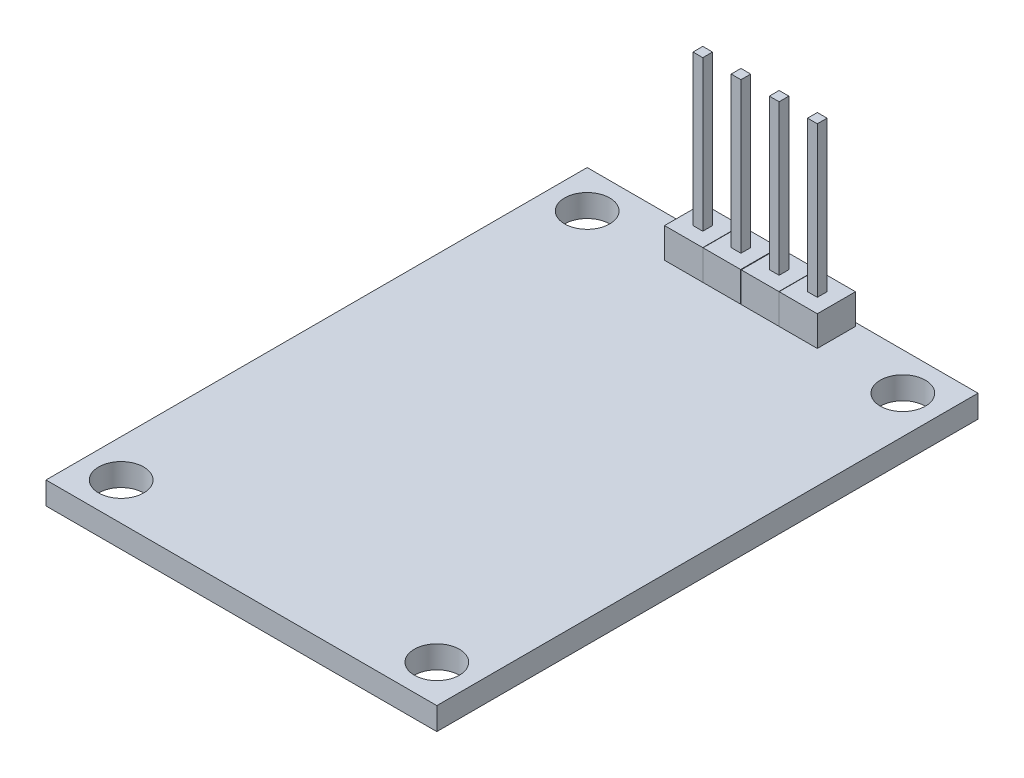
from build123d import *

# Parameters (mm, degrees)
SKETCH1_W                = 26
SKETCH1_H                = 36
BOSS_EXTRUDE1_DEPTH      = 1.5
SKETCH2_R                = 1.5
CUT_EXTRUDE1_DEPTH       = 1.5
SKETCH3_W                = 2.5
SKETCH3_H                = 2.54
SKETCH3_W_2              = 2.54
BOSS_EXTRUDE2_DEPTH      = 2
BOSS_EXTRUDE3_DEPTH      = 10
BOSS_EXTRUDE3_DEPTH_BACK = 5
SKETCH4_W                = 0.65
SKETCH4_H                = 0.65
SKETCH5_W                = 15
SKETCH5_H                = 11.5
BOSS_EXTRUDE4_DEPTH      = 2.5
SKETCH6_W                = 1.833556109
SKETCH6_H                = 1.290280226
SKETCH6_W_2              = 1.969375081
SKETCH6_W_3              = 1.697737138
SKETCH6_W_4              = 1.561918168
BOSS_EXTRUDE5_DEPTH      = 1.5
FILLET1_R                = 0.5
CUT_EXTRUDE2_DEPTH       = 0.5


with BuildPart() as part:
    # Sketch1 → Boss-Extrude1 (new body)
    with BuildSketch(Plane(origin=(0, 0, 0), x_dir=(1, 0, 0), z_dir=(0, 1, 0))):
        Rectangle(SKETCH1_W, SKETCH1_H)
    extrude(amount=BOSS_EXTRUDE1_DEPTH)

    # Sketch2 → Cut-Extrude1 (cut)
    with BuildSketch(Plane(origin=(0, 1.5, 0), x_dir=(1, 0, 0), z_dir=(0, 1, 0))):
        with Locations(Location((-10.5, 15.5, 0), (0, 0, 270))):
            Circle(SKETCH2_R)
        with Locations(Location((10.5, 15.5, 0), (0, 0, 270))):
            Circle(SKETCH2_R)
        with Locations(Location((10.5, -15.5, 0), (0, 0, 270))):
            Circle(SKETCH2_R)
        with Locations(Location((-10.5, -15.5, 0), (0, 0, 270))):
            Circle(SKETCH2_R)
    extrude(amount=-CUT_EXTRUDE1_DEPTH, mode=Mode.SUBTRACT)

    # Sketch3 → Boss-Extrude2 (add)
    with BuildSketch(Plane(origin=(0, 1.5, 0), x_dir=(1, 0, 0), z_dir=(0, 1, 0))):
        with Locations((1.27, 16.5)):
            Rectangle(SKETCH3_W, SKETCH3_H)
        with Locations((-3.81, 16.5)):
            Rectangle(SKETCH3_W_2, SKETCH3_H)
        with Locations((3.81, 16.5)):
            Rectangle(SKETCH3_W_2, SKETCH3_H)
        with Locations((-1.27, 16.5)):
            Rectangle(SKETCH3_W, SKETCH3_H)
    extrude(amount=BOSS_EXTRUDE2_DEPTH)

    # Sketch4 → Boss-Extrude3 (add, two sides: drawn at the far end of the back side and taken through both)
    with BuildSketch(Plane(origin=(0, 3.5, 0), x_dir=(1, 0, 0), z_dir=(0, 1, 0)).offset(-BOSS_EXTRUDE3_DEPTH_BACK)):
        with Locations((-3.81, 16.5)):
            Rectangle(SKETCH4_W, SKETCH4_H)
        with Locations((-1.27, 16.5)):
            Rectangle(SKETCH4_W, SKETCH4_H)
        with Locations((1.27, 16.5)):
            Rectangle(SKETCH4_W, SKETCH4_H)
        with Locations((3.81, 16.5)):
            Rectangle(SKETCH4_W, SKETCH4_H)
    extrude(amount=BOSS_EXTRUDE3_DEPTH + BOSS_EXTRUDE3_DEPTH_BACK)

    # Sketch5 → Boss-Extrude4 (add)
    with BuildSketch(Plane.XZ):
        with Locations((0, 0.75)):
            Rectangle(SKETCH5_W, SKETCH5_H)
    extrude(amount=BOSS_EXTRUDE4_DEPTH)

    # Sketch6 → Boss-Extrude5 (add)
    with BuildSketch(Plane.XZ):
        with Locations((1.078775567, -11.02953631)):
            Rectangle(SKETCH6_W, SKETCH6_H)
        with Locations((3.455607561, -11.02953631)):
            Rectangle(SKETCH6_W_2, SKETCH6_H)
        with Locations((5.832439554, -11.02953631)):
            Rectangle(SKETCH6_W_3, SKETCH6_H)
        with Locations((8.039497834, -11.02953631)):
            Rectangle(SKETCH6_W_4, SKETCH6_H)
    extrude(amount=BOSS_EXTRUDE5_DEPTH)

    # Fillet1
    fillet1_edges = [part.edges().sort_by_distance(p)[0] for p in [
        (7.5, -2.5, 0.75),
        (0, -2.5, 6.5),
        (-7.5, -2.5, 0.75),
        (0, -2.5, -5),
    ]]
    fillet(fillet1_edges, radius=FILLET1_R)

    # Sketch7 → Cut-Extrude2 (cut)
    # profile 1 of 3: a face of its own
    with BuildSketch(Plane.XZ.offset(2.5)):
        with BuildLine():
            Line((-0.95224416, 1.042060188), (-1.221474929, 0.786851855))
            add(Edge.make_bspline(
                [(-1.221474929, 0.786851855), (-1.270193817, 0.832682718), (-1.366469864, 0.923251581), (-1.523430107, 1.040762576), (-1.687193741, 1.141428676), (-1.856906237, 1.223334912), (-2.028364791, 1.288687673), (-2.199293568, 1.335215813), (-2.367939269, 1.364888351), (-2.480106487, 1.36843672), (-2.535377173, 1.370185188)],
                knots=[0, 0, 0, 0, 1.08915593, 2.152340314, 3.188132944, 4.216796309, 5.218260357, 6.173443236, 7.099959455, 8, 8, 8, 8], degree=3))
            add(Edge.make_bspline(
                [(-2.535377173, 1.370185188), (-2.569291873, 1.369771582), (-2.637033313, 1.368945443), (-2.737655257, 1.358401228), (-2.837221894, 1.343236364), (-2.935545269, 1.321294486), (-3.032816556, 1.293485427), (-3.128697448, 1.258699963), (-3.223366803, 1.218144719), (-3.315932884, 1.171282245), (-3.405673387, 1.119802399), (-3.490430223, 1.062753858), (-3.570743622, 1.001965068), (-3.645104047, 0.935914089), (-3.713939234, 0.865199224), (-3.778887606, 0.791135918), (-3.837664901, 0.711700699), (-3.890756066, 0.628355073), (-3.938117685, 0.542562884), (-3.979926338, 0.455149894), (-4.015023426, 0.36640604), (-4.042792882, 0.276219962), (-4.065703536, 0.185289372), (-4.081821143, 0.092984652), (-4.090907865, -0.000793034), (-4.092479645, -0.063590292), (-4.093269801, -0.095159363)],
                knots=[0, 0, 0, 0, 1.02818874, 2.053710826, 3.065248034, 4.081641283, 5.106893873, 6.131558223, 7.173050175, 8.228653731, 9.27666206, 10.308777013, 11.325269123, 12.329503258, 13.32196095, 14.316845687, 15.314881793, 16.315733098, 17.311955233, 18.285320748, 19.252783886, 20.203351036, 21.145449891, 22.095197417, 23.042428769, 24, 24, 24, 24], degree=3))
            add(Edge.make_bspline(
                [(-4.093269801, -0.095159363), (-4.092514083, -0.12743018), (-4.09100471, -0.191883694), (-4.08134439, -0.288077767), (-4.06341615, -0.382843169), (-4.039448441, -0.476491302), (-4.009467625, -0.56918255), (-3.972094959, -0.66051506), (-3.927829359, -0.750485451), (-3.876592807, -0.838283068), (-3.820406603, -0.923806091), (-3.757463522, -1.004365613), (-3.690602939, -1.08103439), (-3.617389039, -1.152110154), (-3.540169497, -1.21949405), (-3.456637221, -1.281329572), (-3.36843476, -1.338807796), (-3.275427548, -1.391204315), (-3.178624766, -1.438012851), (-3.079368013, -1.479636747), (-2.977340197, -1.513916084), (-2.873077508, -1.541854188), (-2.766704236, -1.564754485), (-2.657680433, -1.579486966), (-2.546807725, -1.590177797), (-2.472069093, -1.590959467), (-2.434415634, -1.591353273)],
                knots=[0, 0, 0, 0, 0.93586088, 1.869166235, 2.799637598, 3.729985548, 4.670839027, 5.622275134, 6.589130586, 7.576015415, 8.568469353, 9.55398029, 10.53834874, 11.515998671, 12.510579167, 13.508179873, 14.527009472, 15.561807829, 16.601455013, 17.643573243, 18.680854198, 19.719860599, 20.772568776, 21.833555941, 22.908541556, 24, 24, 24, 24], degree=3))
            add(Edge.make_bspline(
                [(-2.434415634, -1.591353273), (-2.389037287, -1.590404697), (-2.29992953, -1.588542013), (-2.168943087, -1.574041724), (-2.043140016, -1.55139493), (-1.922873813, -1.518229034), (-1.808004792, -1.475925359), (-1.698111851, -1.424929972), (-1.594060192, -1.363286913), (-1.495537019, -1.293713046), (-1.404779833, -1.216198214), (-1.322925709, -1.132553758), (-1.25128022, -1.043185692), (-1.188775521, -0.948620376), (-1.137066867, -0.848075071), (-1.094624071, -0.742042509), (-1.06209078, -0.630474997), (-1.048735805, -0.553383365), (-1.04198775, -0.514430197)],
                knots=[0, 0, 0, 0, 1.13008108, 2.219097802, 3.278683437, 4.311054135, 5.322181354, 6.324827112, 7.324222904, 8.330512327, 9.32562643, 10.293043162, 11.24128371, 12.174520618, 13.111833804, 14.052305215, 15.015860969, 16, 16, 16, 16], degree=3))
            Line((-1.04198775, -0.514430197), (-2.208654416, -0.514430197))
            Line((-2.208654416, -0.514430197), (-2.208654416, -0.155455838))
            Line((-2.208654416, -0.155455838), (-0.727885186, -0.155455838))
            add(Edge.make_bspline(
                [(-0.727885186, -0.155455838), (-0.729591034, -0.222363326), (-0.732929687, -0.353313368), (-0.756348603, -0.544283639), (-0.794165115, -0.724655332), (-0.845825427, -0.894618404), (-0.912700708, -1.053931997), (-0.994073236, -1.202757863), (-1.091245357, -1.340134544), (-1.200755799, -1.467183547), (-1.323655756, -1.58051276), (-1.456624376, -1.680118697), (-1.599881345, -1.764021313), (-1.753291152, -1.832281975), (-1.916351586, -1.88555597), (-2.089439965, -1.923327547), (-2.272321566, -1.94595751), (-2.397658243, -1.94884889), (-2.461759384, -1.950327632)],
                knots=[0, 0, 0, 0, 1.140356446, 2.231883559, 3.274166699, 4.278491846, 5.25512956, 6.21435461, 7.1637429, 8.11826594, 9.068280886, 10.0076534, 10.945064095, 11.891975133, 12.864533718, 13.863980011, 14.907571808, 16, 16, 16, 16], degree=3))
            add(Edge.make_bspline(
                [(-2.461759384, -1.950327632), (-2.50126952, -1.949758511), (-2.579196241, -1.948636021), (-2.694287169, -1.940658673), (-2.806204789, -1.928378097), (-2.914932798, -1.909832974), (-3.02087114, -1.887118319), (-3.123490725, -1.858031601), (-3.223182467, -1.824362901), (-3.320100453, -1.786067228), (-3.413365, -1.741695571), (-3.503391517, -1.692385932), (-3.590677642, -1.638392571), (-3.674628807, -1.578781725), (-3.755682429, -1.513999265), (-3.833315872, -1.443915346), (-3.907963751, -1.368744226), (-3.954724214, -1.315365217), (-3.978285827, -1.288468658)],
                knots=[0, 0, 0, 0, 1.107784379, 2.184907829, 3.233506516, 4.263428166, 5.276301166, 6.270063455, 7.25232949, 8.225834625, 9.190232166, 10.146266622, 11.1027726, 12.066435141, 13.031522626, 14.010570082, 14.99756817, 16, 16, 16, 16], degree=3))
            add(Edge.make_bspline(
                [(-3.978285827, -1.288468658), (-4.012471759, -1.245798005), (-4.080276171, -1.161164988), (-4.167554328, -1.025565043), (-4.241955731, -0.885163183), (-4.302323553, -0.739568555), (-4.349461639, -0.588917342), (-4.383267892, -0.433402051), (-4.403075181, -0.27282242), (-4.405928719, -0.164157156), (-4.407372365, -0.109181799)],
                knots=[0, 0, 0, 0, 1.023165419, 2.029347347, 3.013907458, 3.994755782, 4.975994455, 5.96558838, 6.970761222, 8, 8, 8, 8], degree=3))
            add(Edge.make_bspline(
                [(-4.407372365, -0.109181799), (-4.406840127, -0.068015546), (-4.405782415, 0.013793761), (-4.392956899, 0.135251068), (-4.374555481, 0.254551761), (-4.347508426, 0.371598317), (-4.313412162, 0.486468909), (-4.270858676, 0.599216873), (-4.22131378, 0.709908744), (-4.163728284, 0.817782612), (-4.099643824, 0.921407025), (-4.030093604, 1.020364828), (-3.954090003, 1.112853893), (-3.872874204, 1.200045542), (-3.785477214, 1.280844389), (-3.69271779, 1.355998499), (-3.594524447, 1.425608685), (-3.490588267, 1.48857852), (-3.382460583, 1.54514214), (-3.270400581, 1.594731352), (-3.15444247, 1.635714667), (-3.035454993, 1.670488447), (-2.912537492, 1.696203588), (-2.786581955, 1.714852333), (-2.656931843, 1.727612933), (-2.569295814, 1.728639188), (-2.524860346, 1.729159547)],
                knots=[0, 0, 0, 0, 1.008945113, 2.00506715, 2.99143336, 3.967273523, 4.948097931, 5.927297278, 6.919902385, 7.919676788, 8.923139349, 9.905703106, 10.883022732, 11.856032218, 12.825136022, 13.798837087, 14.781400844, 15.773989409, 16.776158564, 17.77167057, 18.775803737, 19.789618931, 20.80898985, 21.851988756, 22.910860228, 24, 24, 24, 24], degree=3))
            add(Edge.make_bspline(
                [(-2.524860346, 1.729159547), (-2.488622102, 1.728580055), (-2.416765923, 1.727430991), (-2.309840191, 1.719466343), (-2.204567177, 1.706842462), (-2.100790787, 1.689615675), (-1.99886442, 1.666151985), (-1.898497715, 1.6380737), (-1.799545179, 1.605381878), (-1.70231693, 1.566393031), (-1.606159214, 1.522139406), (-1.510537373, 1.472325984), (-1.415778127, 1.416100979), (-1.321717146, 1.353297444), (-1.227761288, 1.284994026), (-1.135396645, 1.209237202), (-1.042393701, 1.129014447), (-0.982591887, 1.071332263), (-0.95224416, 1.042060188)],
                knots=[0, 0, 0, 0, 0.985871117, 1.954866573, 2.915460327, 3.869826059, 4.81536089, 5.759505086, 6.70452669, 7.649098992, 8.607881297, 9.583363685, 10.581137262, 11.603961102, 12.659522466, 13.73993555, 14.853081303, 16, 16, 16, 16], degree=3))
        make_face()
    # profile 2 of 3: a face of its own
    with BuildSketch(Plane.XZ.offset(2.5)):
        with BuildLine():
            Line((-0.009936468, 1.639415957), (0.676461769, 1.639415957))
            add(Edge.make_bspline(
                [(0.676461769, 1.639415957), (0.723672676, 1.639364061), (0.814130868, 1.639264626), (0.943845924, 1.63624988), (1.061655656, 1.632223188), (1.167306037, 1.626641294), (1.261122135, 1.620044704), (1.342679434, 1.610792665), (1.412618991, 1.601132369), (1.45452544, 1.591310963), (1.47363725, 1.586831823)],
                knots=[0, 0, 0, 0, 1.415646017, 2.712440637, 3.8905458, 4.950247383, 5.884950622, 6.709939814, 7.411656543, 8, 8, 8, 8], degree=3))
            add(Edge.make_bspline(
                [(1.47363725, 1.586831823), (1.497830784, 1.580209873), (1.545647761, 1.567122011), (1.614548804, 1.540908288), (1.68010265, 1.509826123), (1.742534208, 1.474402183), (1.801076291, 1.433116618), (1.856602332, 1.387643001), (1.908622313, 1.336931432), (1.956843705, 1.281550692), (2.001128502, 1.222430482), (2.039258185, 1.158688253), (2.071185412, 1.091396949), (2.098568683, 1.020603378), (2.118277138, 0.945713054), (2.133124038, 0.867246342), (2.142547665, 0.785211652), (2.143450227, 0.729151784), (2.143909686, 0.700613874)],
                knots=[0, 0, 0, 0, 0.999701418, 1.975846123, 2.934577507, 3.890451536, 4.834027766, 5.787354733, 6.749476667, 7.726910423, 8.712836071, 9.690891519, 10.682875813, 11.679750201, 12.712814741, 13.765529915, 14.8625177, 16, 16, 16, 16], degree=3))
            add(Edge.make_bspline(
                [(2.143909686, 0.700613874), (2.143488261, 0.671836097), (2.142663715, 0.615530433), (2.13276743, 0.533157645), (2.119437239, 0.454439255), (2.098940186, 0.379549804), (2.072094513, 0.308934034), (2.04060246, 0.241512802), (2.00261893, 0.17843313), (1.9589741, 0.119466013), (1.910422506, 0.0645561), (1.857169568, 0.014101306), (1.799430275, -0.031603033), (1.737388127, -0.072659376), (1.670438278, -0.108115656), (1.599596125, -0.139872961), (1.524245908, -0.166544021), (1.472103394, -0.180574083), (1.445592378, -0.18770744)],
                knots=[0, 0, 0, 0, 1.121902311, 2.195077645, 3.232258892, 4.234102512, 5.217864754, 6.176164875, 7.132989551, 8.084763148, 9.034132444, 9.988522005, 10.94243251, 11.903244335, 12.886203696, 13.894208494, 14.929344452, 16, 16, 16, 16], degree=3))
            add(Edge.make_bspline(
                [(1.445592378, -0.18770744), (1.423665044, -0.192370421), (1.375610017, -0.202589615), (1.296467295, -0.213998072), (1.204321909, -0.223735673), (1.099299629, -0.23103681), (0.981494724, -0.237287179), (0.850843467, -0.242255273), (0.70708939, -0.244985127), (0.606818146, -0.245125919), (0.554466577, -0.245199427)],
                knots=[0, 0, 0, 0, 0.601384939, 1.31797006, 2.144135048, 3.087295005, 4.142315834, 5.309527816, 6.595305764, 8, 8, 8, 8], degree=3))
            Line((0.554466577, -0.245199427), (0.304166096, -0.245199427))
            Line((0.304166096, -0.245199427), (0.304166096, -1.860584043))
            Line((0.304166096, -1.860584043), (-0.009936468, -1.860584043))
            Line((-0.009936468, -1.860584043), (-0.009936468, 1.639415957))
        make_face()
        with BuildLine():
            Line((0.304166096, 1.280441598), (0.304166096, 0.113774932))
            Line((0.304166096, 0.113774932), (0.916946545, 0.106062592))
            add(Edge.make_bspline(
                [(0.916946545, 0.106062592), (0.946866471, 0.106047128), (1.004626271, 0.106017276), (1.088062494, 0.1100025), (1.165471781, 0.114603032), (1.236616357, 0.121338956), (1.301528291, 0.130860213), (1.36031582, 0.140471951), (1.412523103, 0.154377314), (1.473622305, 0.173100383), (1.541705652, 0.205032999), (1.615773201, 0.251382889), (1.678543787, 0.310463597), (1.732862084, 0.376891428), (1.775967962, 0.450790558), (1.807523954, 0.529859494), (1.826065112, 0.613287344), (1.828551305, 0.670375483), (1.829807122, 0.69921163)],
                knots=[0, 0, 0, 0, 1.160613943, 2.240541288, 3.23993089, 4.169200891, 5.011653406, 5.7853311, 6.478053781, 7.106038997, 8.262395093, 9.384106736, 10.481365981, 11.59014053, 12.70357646, 13.786202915, 14.881775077, 16, 16, 16, 16], degree=3))
            add(Edge.make_bspline(
                [(1.829807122, 0.69921163), (1.828544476, 0.727350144), (1.826034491, 0.783286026), (1.807378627, 0.865264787), (1.776029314, 0.943500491), (1.732572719, 1.016473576), (1.679831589, 1.08266238), (1.618532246, 1.140159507), (1.548818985, 1.18638121), (1.483970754, 1.216214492), (1.426369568, 1.234429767), (1.376337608, 1.247174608), (1.319846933, 1.257350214), (1.256879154, 1.265589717), (1.18792232, 1.272643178), (1.112384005, 1.277429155), (1.030550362, 1.280230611), (0.973739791, 1.280369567), (0.944290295, 1.280441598)],
                knots=[0, 0, 0, 0, 1.120700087, 2.227813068, 3.331159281, 4.466773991, 5.599788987, 6.693661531, 7.80175334, 8.91857717, 9.525282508, 10.207424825, 10.974604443, 11.810962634, 12.737642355, 13.736264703, 14.826523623, 16, 16, 16, 16], degree=3))
            Line((0.944290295, 1.280441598), (0.304166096, 1.280441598))
        make_face(mode=Mode.SUBTRACT)
    # profile 3 of 3: a face of its own
    with BuildSketch(Plane.XZ.offset(2.5)):
        with BuildLine():
            Line((2.502884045, -1.185403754), (2.798757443, -1.00801994))
            add(Edge.make_bspline(
                [(2.798757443, -1.00801994), (2.82627568, -1.054084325), (2.87899956, -1.142341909), (2.96695092, -1.261599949), (3.058083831, -1.362962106), (3.153073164, -1.445838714), (3.251339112, -1.5110876), (3.353523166, -1.557289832), (3.459280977, -1.586105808), (3.531254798, -1.589605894), (3.56718693, -1.591353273)],
                knots=[0, 0, 0, 0, 1.272034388, 2.437168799, 3.508375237, 4.49857839, 5.41946034, 6.295179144, 7.148887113, 8, 8, 8, 8], degree=3))
            add(Edge.make_bspline(
                [(3.56718693, -1.591353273), (3.59787379, -1.590498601), (3.658710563, -1.588804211), (3.748272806, -1.572523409), (3.835254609, -1.54751128), (3.917863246, -1.511690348), (3.994958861, -1.468351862), (4.062565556, -1.416005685), (4.121011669, -1.357399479), (4.168820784, -1.292016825), (4.205500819, -1.221699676), (4.233692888, -1.149523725), (4.249337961, -1.074355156), (4.251694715, -1.023744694), (4.252884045, -0.998204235)],
                knots=[0, 0, 0, 0, 1.095163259, 2.171163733, 3.241058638, 4.321873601, 5.38011039, 6.391990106, 7.366004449, 8.327778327, 9.272591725, 10.192022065, 11.087607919, 12, 12, 12, 12], degree=3))
            add(Edge.make_bspline(
                [(4.252884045, -0.998204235), (4.251409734, -0.969063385), (4.248412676, -0.909824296), (4.223081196, -0.822424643), (4.183231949, -0.735932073), (4.146469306, -0.682430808), (4.127383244, -0.654654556)],
                knots=[0, 0, 0, 0, 0.938893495, 1.908633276, 2.914225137, 4, 4, 4, 4], degree=3))
            add(Edge.make_bspline(
                [(4.127383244, -0.654654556), (4.11171263, -0.634607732), (4.078814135, -0.592521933), (4.022256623, -0.529876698), (3.955890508, -0.465258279), (3.881986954, -0.396199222), (3.797853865, -0.325911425), (3.70612635, -0.251043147), (3.604462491, -0.17444157), (3.533162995, -0.123069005), (3.496373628, -0.096561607)],
                knots=[0, 0, 0, 0, 0.722233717, 1.516239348, 2.393582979, 3.351407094, 4.387010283, 5.505090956, 6.712668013, 8, 8, 8, 8], degree=3))
            add(Edge.make_bspline(
                [(3.496373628, -0.096561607), (3.459549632, -0.070333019), (3.389144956, -0.020185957), (3.290686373, 0.054238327), (3.20264191, 0.122282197), (3.125402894, 0.184586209), (3.059003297, 0.241158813), (3.002919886, 0.291456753), (2.958581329, 0.336840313), (2.933925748, 0.366281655), (2.922856, 0.379500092)],
                knots=[0, 0, 0, 0, 1.452282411, 2.77665338, 3.964542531, 5.026858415, 5.96415736, 6.766646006, 7.446254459, 8, 8, 8, 8], degree=3))
            add(Edge.make_bspline(
                [(2.922856, 0.379500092), (2.907383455, 0.400101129), (2.876954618, 0.440615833), (2.836788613, 0.50394069), (2.80264945, 0.568763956), (2.775887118, 0.63525982), (2.753350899, 0.702494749), (2.738192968, 0.771345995), (2.728701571, 0.841504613), (2.727729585, 0.888718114), (2.727243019, 0.912352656)],
                knots=[0, 0, 0, 0, 1.068054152, 2.10047183, 3.106115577, 4.101338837, 5.06977816, 6.043150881, 7.020423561, 8, 8, 8, 8], degree=3))
            add(Edge.make_bspline(
                [(2.727243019, 0.912352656), (2.728548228, 0.949382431), (2.731130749, 1.022650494), (2.752971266, 1.129681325), (2.787444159, 1.231867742), (2.835739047, 1.328198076), (2.8979964, 1.416164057), (2.970042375, 1.496777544), (3.055853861, 1.564546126), (3.150006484, 1.623758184), (3.253062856, 1.670104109), (3.36105376, 1.70506509), (3.474150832, 1.724874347), (3.550753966, 1.727717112), (3.589622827, 1.729159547)],
                knots=[0, 0, 0, 0, 1.005424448, 1.989358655, 2.955360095, 3.929531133, 4.905563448, 5.876582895, 6.856512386, 7.866279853, 8.892233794, 9.918561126, 10.94386622, 12, 12, 12, 12], degree=3))
            add(Edge.make_bspline(
                [(3.589622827, 1.729159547), (3.630866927, 1.727736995), (3.712888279, 1.724907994), (3.833537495, 1.700310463), (3.949698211, 1.659609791), (4.043141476, 1.613421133), (4.116274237, 1.567289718), (4.17204697, 1.525269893), (4.228564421, 1.476894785), (4.286282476, 1.422035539), (4.344223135, 1.360188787), (4.403246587, 1.291778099), (4.463490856, 1.217221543), (4.502246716, 1.163997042), (4.522114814, 1.13671163)],
                knots=[0, 0, 0, 0, 1.286793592, 2.559021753, 3.825965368, 5.121522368, 5.803751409, 6.523245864, 7.299691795, 8.125521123, 9.008227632, 9.944561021, 10.946284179, 12, 12, 12, 12], degree=3))
            Line((4.522114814, 1.13671163), (4.238160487, 0.921467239))
            add(Edge.make_bspline(
                [(4.238160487, 0.921467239), (4.221014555, 0.94355593), (4.187995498, 0.986093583), (4.137866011, 1.045664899), (4.090617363, 1.100081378), (4.044066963, 1.147346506), (4.000673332, 1.19004864), (3.95855629, 1.226608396), (3.918321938, 1.257383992), (3.867605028, 1.290227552), (3.803887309, 1.322784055), (3.723902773, 1.350333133), (3.640316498, 1.366888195), (3.583386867, 1.369077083), (3.554566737, 1.370185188)],
                knots=[0, 0, 0, 0, 1.181633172, 2.275549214, 3.290209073, 4.226197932, 5.078386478, 5.862611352, 6.581680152, 7.217281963, 8.414376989, 9.595101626, 10.782541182, 12, 12, 12, 12], degree=3))
            add(Edge.make_bspline(
                [(3.554566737, 1.370185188), (3.518410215, 1.368973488), (3.448685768, 1.366636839), (3.349695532, 1.341116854), (3.260601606, 1.300934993), (3.184049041, 1.244620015), (3.120312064, 1.177899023), (3.074206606, 1.101120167), (3.046456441, 1.016337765), (3.043070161, 0.957196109), (3.041345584, 0.927076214)],
                knots=[0, 0, 0, 0, 1.14458467, 2.207223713, 3.21896685, 4.227309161, 5.202851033, 6.127160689, 7.046193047, 8, 8, 8, 8], degree=3))
            add(Edge.make_bspline(
                [(3.041345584, 0.927076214), (3.04173871, 0.908324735), (3.042525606, 0.870791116), (3.053500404, 0.815339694), (3.067599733, 0.760028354), (3.089942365, 0.705105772), (3.120787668, 0.649611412), (3.161292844, 0.592589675), (3.212306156, 0.533537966), (3.251383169, 0.495130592), (3.272014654, 0.474852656)],
                knots=[0, 0, 0, 0, 0.858281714, 1.717966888, 2.583508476, 3.4729293, 4.427298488, 5.488583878, 6.674047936, 8, 8, 8, 8], degree=3))
            add(Edge.make_bspline(
                [(3.272014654, 0.474852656), (3.279676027, 0.46801563), (3.297877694, 0.451772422), (3.331153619, 0.425180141), (3.375096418, 0.392377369), (3.428558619, 0.351790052), (3.492525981, 0.30470859), (3.567005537, 0.251734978), (3.65116707, 0.191149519), (3.710888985, 0.148791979), (3.742467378, 0.126395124)],
                knots=[0, 0, 0, 0, 0.420754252, 0.999615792, 1.744751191, 2.668019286, 3.750313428, 4.999500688, 6.413464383, 8, 8, 8, 8], degree=3))
            add(Edge.make_bspline(
                [(3.742467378, 0.126395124), (3.780453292, 0.098753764), (3.854007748, 0.045230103), (3.958665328, -0.035185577), (4.053559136, -0.113833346), (4.13902234, -0.190210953), (4.215899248, -0.263739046), (4.283336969, -0.335302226), (4.342022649, -0.404387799), (4.405201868, -0.492960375), (4.469759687, -0.601741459), (4.525201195, -0.735019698), (4.560159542, -0.868816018), (4.564731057, -0.958742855), (4.566986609, -1.003112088)],
                knots=[0, 0, 0, 0, 1.163667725, 2.253281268, 3.268753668, 4.215851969, 5.092017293, 5.902905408, 6.650798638, 7.335211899, 8.59617414, 9.77448103, 10.901945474, 12, 12, 12, 12], degree=3))
            add(Edge.make_bspline(
                [(4.566986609, -1.003112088), (4.566329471, -1.034490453), (4.565027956, -1.096637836), (4.550067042, -1.187892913), (4.528147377, -1.276523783), (4.495110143, -1.361434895), (4.454786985, -1.444179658), (4.403620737, -1.522587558), (4.344313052, -1.598393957), (4.276279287, -1.669577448), (4.201833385, -1.734923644), (4.12314969, -1.793052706), (4.040099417, -1.841521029), (3.953133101, -1.881071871), (3.862230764, -1.912005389), (3.76742298, -1.934418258), (3.668553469, -1.948173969), (3.601352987, -1.94960173), (3.56718693, -1.950327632)],
                knots=[0, 0, 0, 0, 0.983748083, 1.948392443, 2.894712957, 3.844097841, 4.80183111, 5.778335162, 6.776009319, 7.81870978, 8.863265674, 9.881300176, 10.883814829, 11.87499822, 12.874611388, 13.892143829, 14.928324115, 16, 16, 16, 16], degree=3))
            add(Edge.make_bspline(
                [(3.56718693, -1.950327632), (3.540751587, -1.949816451), (3.488213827, -1.948800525), (3.410504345, -1.939819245), (3.334364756, -1.927112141), (3.260750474, -1.906938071), (3.188713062, -1.882461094), (3.118565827, -1.852322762), (3.050274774, -1.81620556), (2.983457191, -1.774910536), (2.918283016, -1.726852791), (2.855363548, -1.670879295), (2.792634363, -1.60853379), (2.731946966, -1.538123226), (2.672073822, -1.460785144), (2.614195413, -1.37579596), (2.557113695, -1.283618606), (2.521298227, -1.218753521), (2.502884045, -1.185403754)],
                knots=[0, 0, 0, 0, 0.915332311, 1.819136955, 2.706846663, 3.586547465, 4.459518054, 5.340707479, 6.227863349, 7.133153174, 8.059268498, 9.028702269, 10.047606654, 11.120612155, 12.245963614, 13.433783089, 14.680604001, 16, 16, 16, 16], degree=3))
        make_face()
    extrude(amount=-CUT_EXTRUDE2_DEPTH, mode=Mode.SUBTRACT)


solid = part.part
